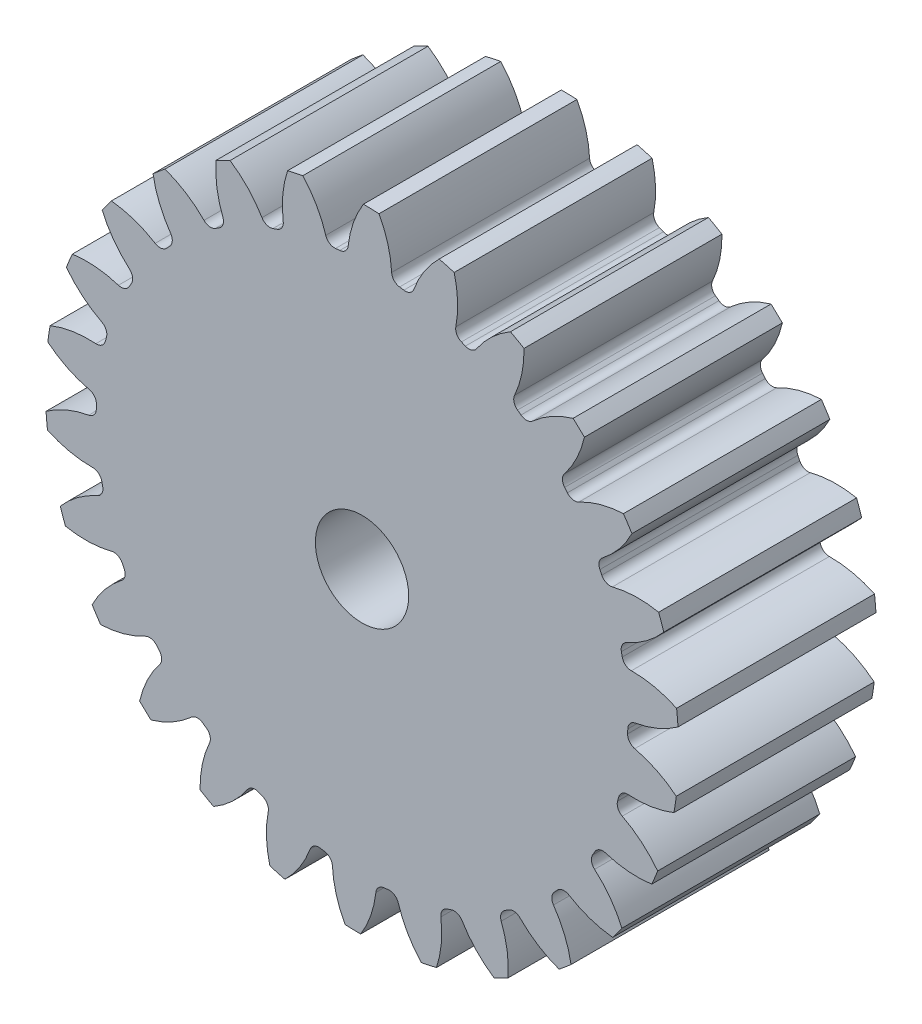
from build123d import *

# Parameters (mm, degrees)
SKETCH3_R         = 142.24
GEARBODY_DEPTH    = 88.9
TOOTHCUT_DEPTH    = 220.92645407
CIRPATTERN1_COUNT = 26
BOREDIA_R         = 20.955
BORE_DEPTH        = 12700


with BuildPart() as part:
    # Sketch3 → gearBody (new body)
    with BuildSketch(Plane.XY):
        Circle(SKETCH3_R)
    extrude(amount=GEARBODY_DEPTH)

    # Sketch2 → toothCut (cut, through all)
    with BuildSketch(Plane.XY):
        with BuildLine():
            ThreePointArc((119.29817118, -4.419361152), (119.330065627, -3.452511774), (119.354124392, -2.48543569))
            ThreePointArc((119.354124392, -2.48543569), (120.348685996, 0.119521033), (122.770840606, 1.500867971))
            ThreePointArc((122.770840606, 1.500867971), (132.98173585, 4.533257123), (142.24, 9.800354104))
            ThreePointArc((142.24, 9.800354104), (142.517585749, -4.12338366), (141.435442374, -18.007781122))
            ThreePointArc((141.435442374, -18.007781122), (132.497190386, -12.214214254), (122.478697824, -8.596539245))
            ThreePointArc((122.478697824, -8.596539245), (120.140459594, -7.077462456), (119.29817118, -4.419361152))
        make_face()
    toothcut = extrude(amount=TOOTHCUT_DEPTH, mode=Mode.SUBTRACT)

    # CirPattern1: toothCut ×26 about axis
    cirpattern1_axis = Axis((0, 0, 0), (0, 0, 1))
    for i in range(1, CIRPATTERN1_COUNT):
        add(toothcut.rotate(cirpattern1_axis, i * 360 / CIRPATTERN1_COUNT), mode=Mode.SUBTRACT)

    # boreDia → bore (cut, symmetric)
    with BuildSketch(Plane.XY):
        Circle(BOREDIA_R)
    extrude(amount=BORE_DEPTH, both=True, mode=Mode.SUBTRACT)


solid = part.part
